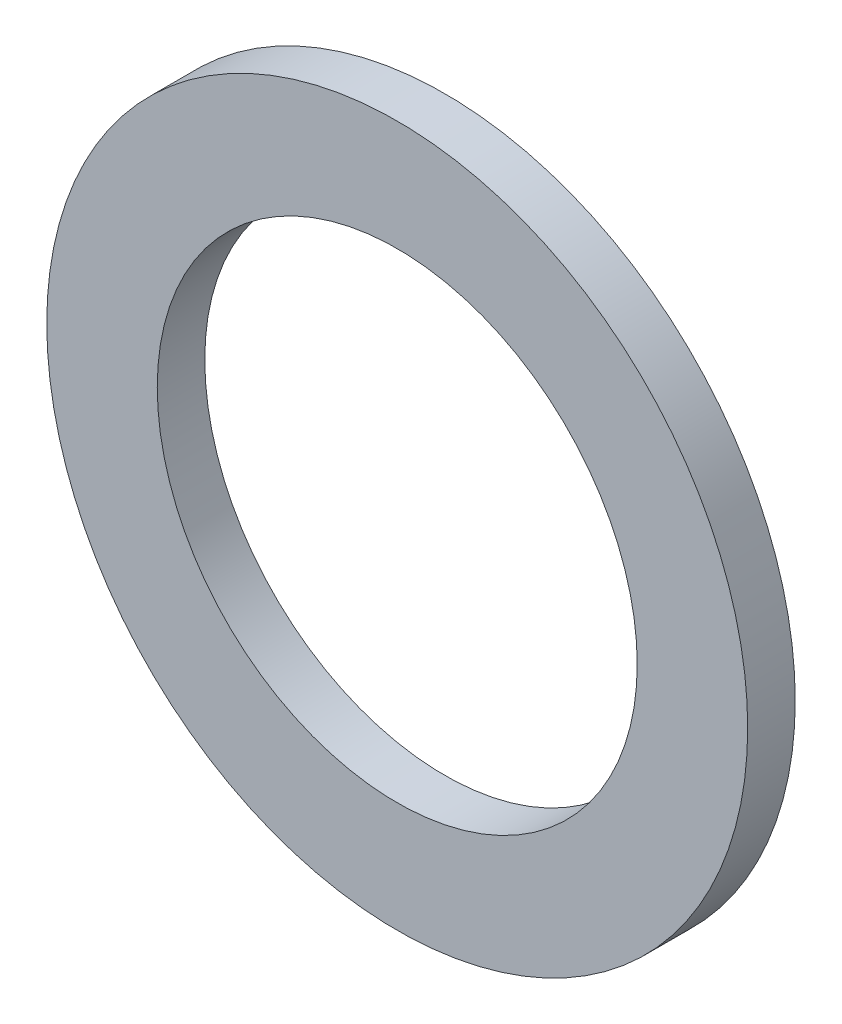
ISO-10303-21;
HEADER;
FILE_DESCRIPTION(('STEP AP214'),'2;1');
FILE_NAME('part.step','',(''),(''),'','','');
FILE_SCHEMA(('AUTOMOTIVE_DESIGN { 1 0 10303 214 1 1 1 1 }'));
ENDSEC;
DATA;
#1=APPLICATION_CONTEXT('core data for automotive mechanical design processes');
#2=APPLICATION_PROTOCOL_DEFINITION('international standard','automotive_design',2000,#1);
#3=PRODUCT_CONTEXT('',#1,'mechanical');
#4=PRODUCT('Part','Part','',(#3));
#5=PRODUCT_RELATED_PRODUCT_CATEGORY('part','',(#4));
#6=PRODUCT_DEFINITION_FORMATION('','',#4);
#7=PRODUCT_DEFINITION_CONTEXT('part definition',#1,'design');
#8=PRODUCT_DEFINITION('design','',#6,#7);
#9=PRODUCT_DEFINITION_SHAPE('','',#8);
#10=(LENGTH_UNIT() NAMED_UNIT(*) SI_UNIT(.MILLI.,.METRE.));
#11=(NAMED_UNIT(*) PLANE_ANGLE_UNIT() SI_UNIT($,.RADIAN.));
#12=(NAMED_UNIT(*) SI_UNIT($,.STERADIAN.) SOLID_ANGLE_UNIT());
#13=UNCERTAINTY_MEASURE_WITH_UNIT(LENGTH_MEASURE(1.E-05),#10,'distance_accuracy_value','');
#14=(GEOMETRIC_REPRESENTATION_CONTEXT(3) GLOBAL_UNCERTAINTY_ASSIGNED_CONTEXT((#13)) GLOBAL_UNIT_ASSIGNED_CONTEXT((#10,
#11,#12)) REPRESENTATION_CONTEXT('',''));
#15=CARTESIAN_POINT('',(0.,0.,0.));
#16=DIRECTION('',(0.,0.,1.));
#17=DIRECTION('',(1.,0.,0.));
#18=AXIS2_PLACEMENT_3D('',#15,#16,#17);
#19=CARTESIAN_POINT('',(16.875,26.9783573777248,3.5));
#20=DIRECTION('',(0.,0.,1.));
#21=DIRECTION('',(1.,0.,0.));
#22=AXIS2_PLACEMENT_3D('',#19,#20,#21);
#23=PLANE('',#22);
#24=CARTESIAN_POINT('',(16.875,26.9783573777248,3.5));
#25=DIRECTION('',(0.,0.,1.));
#26=DIRECTION('',(1.,0.,0.));
#27=AXIS2_PLACEMENT_3D('',#24,#25,#26);
#28=CIRCLE('',#27,7.375);
#29=CARTESIAN_POINT('',(24.25,26.9783573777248,3.5));
#30=VERTEX_POINT('',#29);
#31=EDGE_CURVE('E10',#30,#30,#28,.T.);
#32=ORIENTED_EDGE('',*,*,#31,.T.);
#33=EDGE_LOOP('',(#32));
#34=FACE_BOUND('',#33,.T.);
#35=CARTESIAN_POINT('',(16.875,26.9783573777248,3.5));
#36=DIRECTION('',(0.,0.,1.));
#37=DIRECTION('',(1.,0.,0.));
#38=AXIS2_PLACEMENT_3D('',#35,#36,#37);
#39=CIRCLE('',#38,5.05);
#40=CARTESIAN_POINT('',(21.925,26.9783573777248,3.5));
#41=VERTEX_POINT('',#40);
#42=EDGE_CURVE('E38',#41,#41,#39,.T.);
#43=ORIENTED_EDGE('',*,*,#42,.F.);
#44=EDGE_LOOP('',(#43));
#45=FACE_BOUND('',#44,.T.);
#46=ADVANCED_FACE('F27',(#34,#45),#23,.T.);
#47=CARTESIAN_POINT('',(16.875,26.9783573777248,2.5));
#48=DIRECTION('',(0.,0.,1.));
#49=DIRECTION('',(1.,0.,0.));
#50=AXIS2_PLACEMENT_3D('',#47,#48,#49);
#51=PLANE('',#50);
#52=CARTESIAN_POINT('',(16.875,26.9783573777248,2.5));
#53=DIRECTION('',(0.,0.,1.));
#54=DIRECTION('',(1.,0.,0.));
#55=AXIS2_PLACEMENT_3D('',#52,#53,#54);
#56=CIRCLE('',#55,7.375);
#57=CARTESIAN_POINT('',(24.25,26.9783573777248,2.5));
#58=VERTEX_POINT('',#57);
#59=EDGE_CURVE('E34',#58,#58,#56,.T.);
#60=ORIENTED_EDGE('',*,*,#59,.F.);
#61=EDGE_LOOP('',(#60));
#62=FACE_BOUND('',#61,.T.);
#63=CARTESIAN_POINT('',(16.875,26.9783573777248,2.5));
#64=DIRECTION('',(0.,0.,1.));
#65=DIRECTION('',(1.,0.,0.));
#66=AXIS2_PLACEMENT_3D('',#63,#64,#65);
#67=CIRCLE('',#66,5.05);
#68=CARTESIAN_POINT('',(21.925,26.9783573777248,2.5));
#69=VERTEX_POINT('',#68);
#70=EDGE_CURVE('E42',#69,#69,#67,.T.);
#71=ORIENTED_EDGE('',*,*,#70,.T.);
#72=EDGE_LOOP('',(#71));
#73=FACE_BOUND('',#72,.T.);
#74=ADVANCED_FACE('F48',(#62,#73),#51,.F.);
#75=CARTESIAN_POINT('',(16.875,26.9783573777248,3.5));
#76=DIRECTION('',(0.,0.,-1.));
#77=DIRECTION('',(-1.,0.,0.));
#78=AXIS2_PLACEMENT_3D('',#75,#76,#77);
#79=CYLINDRICAL_SURFACE('',#78,7.375);
#80=ORIENTED_EDGE('',*,*,#31,.F.);
#81=EDGE_LOOP('',(#80));
#82=FACE_BOUND('',#81,.T.);
#83=ORIENTED_EDGE('',*,*,#59,.T.);
#84=EDGE_LOOP('',(#83));
#85=FACE_BOUND('',#84,.T.);
#86=ADVANCED_FACE('F29',(#82,#85),#79,.T.);
#87=CARTESIAN_POINT('',(16.875,26.9783573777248,3.5));
#88=DIRECTION('',(0.,0.,-1.));
#89=DIRECTION('',(-1.,0.,0.));
#90=AXIS2_PLACEMENT_3D('',#87,#88,#89);
#91=CYLINDRICAL_SURFACE('',#90,5.05);
#92=ORIENTED_EDGE('',*,*,#42,.T.);
#93=EDGE_LOOP('',(#92));
#94=FACE_BOUND('',#93,.T.);
#95=ORIENTED_EDGE('',*,*,#70,.F.);
#96=EDGE_LOOP('',(#95));
#97=FACE_BOUND('',#96,.T.);
#98=ADVANCED_FACE('F50',(#94,#97),#91,.F.);
#99=CLOSED_SHELL('',(#46,#74,#86,#98));
#100=MANIFOLD_SOLID_BREP('B2',#99);
#101=ADVANCED_BREP_SHAPE_REPRESENTATION('',(#18,#100),#14);
#102=SHAPE_DEFINITION_REPRESENTATION(#9,#101);
ENDSEC;
END-ISO-10303-21;
